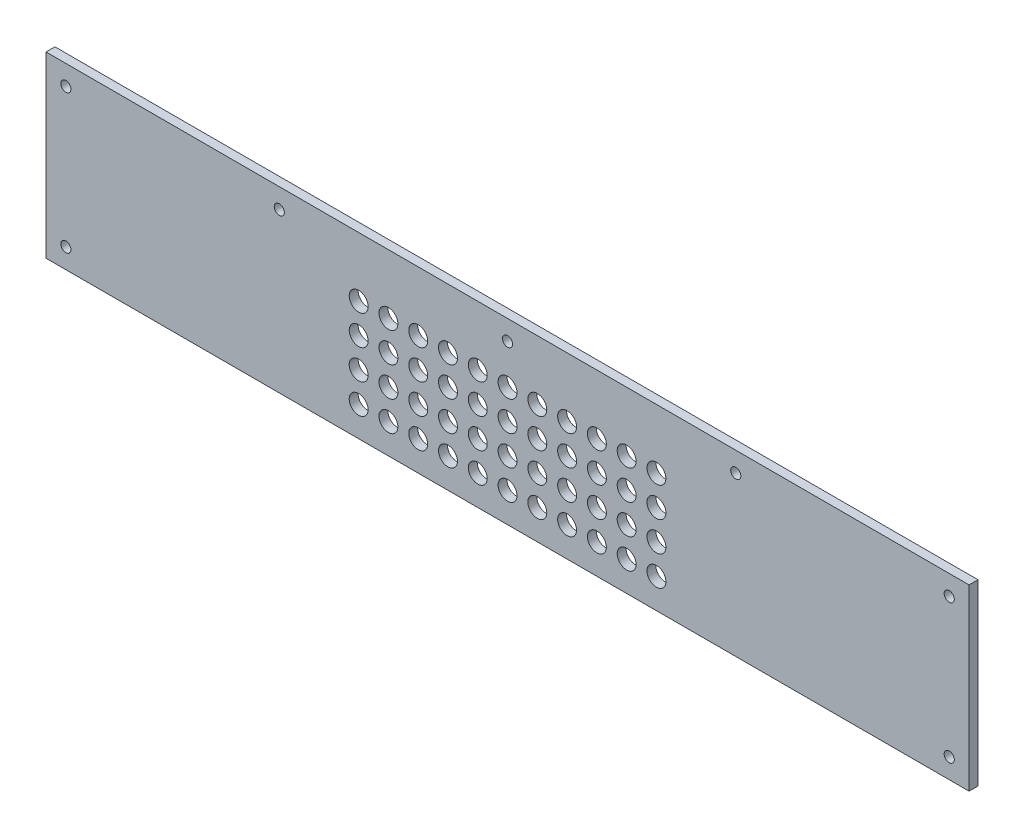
from build123d import *

# Parameters (mm, degrees)
SKETCH1_W           = 465
SKETCH1_H           = 90
SKETCH1_R           = 2.55
BOSS_EXTRUDE1_DEPTH = 2.2479
SKETCH2_R           = 4.7625
CUT_EXTRUDE1_DEPTH  = 4.4958


with BuildPart() as part:
    # Sketch1 → Boss-Extrude1 (new, symmetric)
    with BuildSketch(Plane.XY):
        Rectangle(SKETCH1_W, SKETCH1_H)
        with Locations((-222.5, 35)):
            Circle(SKETCH1_R, mode=Mode.SUBTRACT)
        with Locations((-222.5, -35)):
            Circle(SKETCH1_R, mode=Mode.SUBTRACT)
        with Locations((0, 35)):
            Circle(SKETCH1_R, mode=Mode.SUBTRACT)
        with Locations((-114.975, 35)):
            Circle(SKETCH1_R, mode=Mode.SUBTRACT)
        with Locations(Location((222.5, -35, 0), (0, 0, 180))):
            Circle(SKETCH1_R, mode=Mode.SUBTRACT)
        with Locations(Location((222.5, 35, 0), (0, 0, 180))):
            Circle(SKETCH1_R, mode=Mode.SUBTRACT)
        with Locations(Location((114.975, 35, 0), (0, 0, 180))):
            Circle(SKETCH1_R, mode=Mode.SUBTRACT)
    extrude(amount=BOSS_EXTRUDE1_DEPTH, both=True)

    # Sketch2 → Cut-Extrude1 (cut)
    with BuildSketch(Plane.XY.offset(2.2479)):
        with Locations((0, 15)):
            Circle(SKETCH2_R)
        with Locations((15, 15)):
            Circle(SKETCH2_R)
        with Locations((30, 15)):
            Circle(SKETCH2_R)
        with Locations((45, 15)):
            Circle(SKETCH2_R)
        with Locations((60, 15)):
            Circle(SKETCH2_R)
        with Locations((75, 15)):
            Circle(SKETCH2_R)
        with Locations((15, 0)):
            Circle(SKETCH2_R)
        with Locations((30, 0)):
            Circle(SKETCH2_R)
        with Locations((45, 0)):
            Circle(SKETCH2_R)
        with Locations((60, 0)):
            Circle(SKETCH2_R)
        with Locations((75, 0)):
            Circle(SKETCH2_R)
        with Locations((15, -15)):
            Circle(SKETCH2_R)
        with Locations((30, -15)):
            Circle(SKETCH2_R)
        with Locations((45, -15)):
            Circle(SKETCH2_R)
        with Locations((60, -15)):
            Circle(SKETCH2_R)
        with Locations((75, -15)):
            Circle(SKETCH2_R)
        with Locations((15, -30)):
            Circle(SKETCH2_R)
        with Locations((30, -30)):
            Circle(SKETCH2_R)
        with Locations((45, -30)):
            Circle(SKETCH2_R)
        with Locations((60, -30)):
            Circle(SKETCH2_R)
        with Locations((75, -30)):
            Circle(SKETCH2_R)
        Circle(SKETCH2_R)
        with Locations((0, -15)):
            Circle(SKETCH2_R)
        with Locations((0, -30)):
            Circle(SKETCH2_R)
        with Locations(Location((-75, -30, 0), (0, 0, 180))):
            Circle(SKETCH2_R)
        with Locations(Location((-60, -30, 0), (0, 0, 180))):
            Circle(SKETCH2_R)
        with Locations(Location((-45, -30, 0), (0, 0, 180))):
            Circle(SKETCH2_R)
        with Locations(Location((-30, -30, 0), (0, 0, 180))):
            Circle(SKETCH2_R)
        with Locations(Location((-15, -30, 0), (0, 0, 180))):
            Circle(SKETCH2_R)
        with Locations(Location((-75, -15, 0), (0, 0, 180))):
            Circle(SKETCH2_R)
        with Locations(Location((-60, -15, 0), (0, 0, 180))):
            Circle(SKETCH2_R)
        with Locations(Location((-45, -15, 0), (0, 0, 180))):
            Circle(SKETCH2_R)
        with Locations(Location((-30, -15, 0), (0, 0, 180))):
            Circle(SKETCH2_R)
        with Locations(Location((-15, -15, 0), (0, 0, 180))):
            Circle(SKETCH2_R)
        with Locations(Location((-75, 0, 0), (0, 0, 180))):
            Circle(SKETCH2_R)
        with Locations(Location((-60, 0, 0), (0, 0, 180))):
            Circle(SKETCH2_R)
        with Locations(Location((-45, 0, 0), (0, 0, 180))):
            Circle(SKETCH2_R)
        with Locations(Location((-30, 0, 0), (0, 0, 180))):
            Circle(SKETCH2_R)
        with Locations(Location((-15, 0, 0), (0, 0, 180))):
            Circle(SKETCH2_R)
        with Locations(Location((-75, 15, 0), (0, 0, 180))):
            Circle(SKETCH2_R)
        with Locations(Location((-60, 15, 0), (0, 0, 180))):
            Circle(SKETCH2_R)
        with Locations(Location((-45, 15, 0), (0, 0, 180))):
            Circle(SKETCH2_R)
        with Locations(Location((-30, 15, 0), (0, 0, 180))):
            Circle(SKETCH2_R)
        with Locations(Location((-15, 15, 0), (0, 0, 180))):
            Circle(SKETCH2_R)
    extrude(amount=-CUT_EXTRUDE1_DEPTH, mode=Mode.SUBTRACT)


solid = part.part
